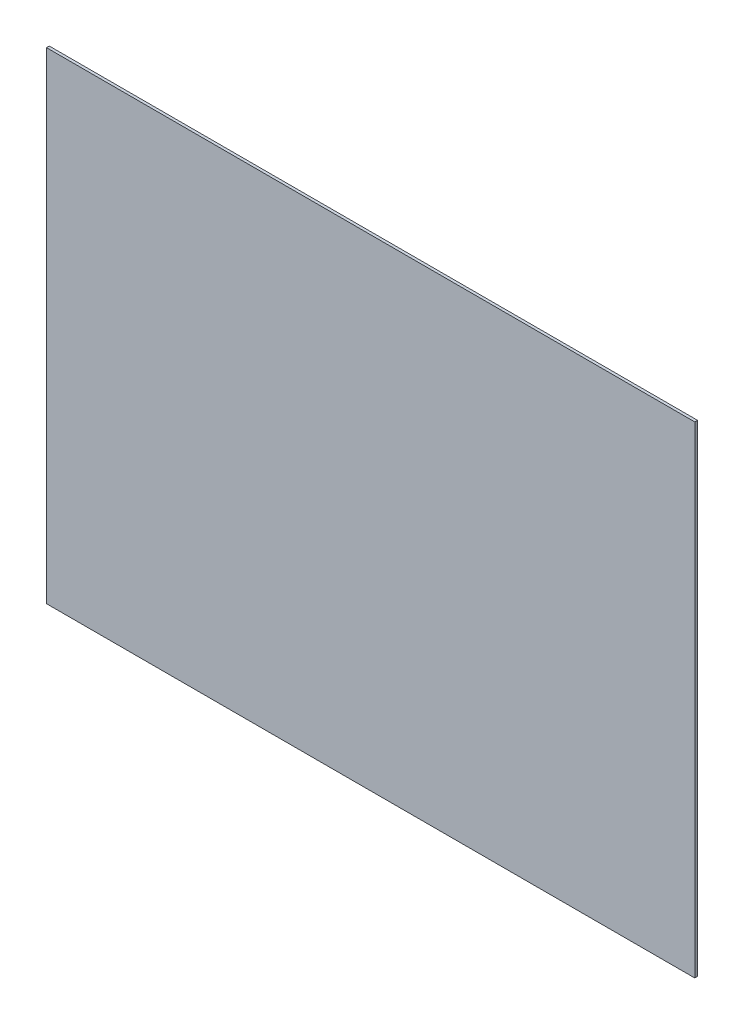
ISO-10303-21;
HEADER;
FILE_DESCRIPTION(('STEP AP214'),'2;1');
FILE_NAME('part.step','',(''),(''),'','','');
FILE_SCHEMA(('AUTOMOTIVE_DESIGN { 1 0 10303 214 1 1 1 1 }'));
ENDSEC;
DATA;
#1=APPLICATION_CONTEXT('core data for automotive mechanical design processes');
#2=APPLICATION_PROTOCOL_DEFINITION('international standard','automotive_design',2000,#1);
#3=PRODUCT_CONTEXT('',#1,'mechanical');
#4=PRODUCT('Part','Part','',(#3));
#5=PRODUCT_RELATED_PRODUCT_CATEGORY('part','',(#4));
#6=PRODUCT_DEFINITION_FORMATION('','',#4);
#7=PRODUCT_DEFINITION_CONTEXT('part definition',#1,'design');
#8=PRODUCT_DEFINITION('design','',#6,#7);
#9=PRODUCT_DEFINITION_SHAPE('','',#8);
#10=(LENGTH_UNIT() NAMED_UNIT(*) SI_UNIT(.MILLI.,.METRE.));
#11=(NAMED_UNIT(*) PLANE_ANGLE_UNIT() SI_UNIT($,.RADIAN.));
#12=(NAMED_UNIT(*) SI_UNIT($,.STERADIAN.) SOLID_ANGLE_UNIT());
#13=UNCERTAINTY_MEASURE_WITH_UNIT(LENGTH_MEASURE(1.E-05),#10,'distance_accuracy_value','');
#14=(GEOMETRIC_REPRESENTATION_CONTEXT(3) GLOBAL_UNCERTAINTY_ASSIGNED_CONTEXT((#13)) GLOBAL_UNIT_ASSIGNED_CONTEXT((#10,
#11,#12)) REPRESENTATION_CONTEXT('',''));
#15=CARTESIAN_POINT('',(0.,0.,0.));
#16=DIRECTION('',(0.,0.,1.));
#17=DIRECTION('',(1.,0.,0.));
#18=AXIS2_PLACEMENT_3D('',#15,#16,#17);
#19=CARTESIAN_POINT('',(-40.,27.,0.300000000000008));
#20=DIRECTION('',(0.,0.,-1.));
#21=DIRECTION('',(-1.,0.,0.));
#22=AXIS2_PLACEMENT_3D('',#19,#20,#21);
#23=PLANE('',#22);
#24=DIRECTION('',(1.,0.,0.));
#25=VECTOR('',#24,1.);
#26=CARTESIAN_POINT('',(30.,-25.,0.299999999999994));
#27=LINE('',#26,#25);
#28=CARTESIAN_POINT('',(30.,-25.,0.299999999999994));
#29=VERTEX_POINT('',#28);
#30=CARTESIAN_POINT('',(-40.,-25.,0.300000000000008));
#31=VERTEX_POINT('',#30);
#32=EDGE_CURVE('E79',#29,#31,#27,.F.);
#33=ORIENTED_EDGE('',*,*,#32,.F.);
#34=DIRECTION('',(0.,1.,0.));
#35=VECTOR('',#34,1.);
#36=CARTESIAN_POINT('',(30.,27.,0.299999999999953));
#37=LINE('',#36,#35);
#38=CARTESIAN_POINT('',(30.,27.,0.299999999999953));
#39=VERTEX_POINT('',#38);
#40=EDGE_CURVE('E67',#39,#29,#37,.F.);
#41=ORIENTED_EDGE('',*,*,#40,.F.);
#42=DIRECTION('',(1.,0.,0.));
#43=VECTOR('',#42,1.);
#44=CARTESIAN_POINT('',(-40.,27.,0.300000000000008));
#45=LINE('',#44,#43);
#46=CARTESIAN_POINT('',(-40.,27.,0.300000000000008));
#47=VERTEX_POINT('',#46);
#48=EDGE_CURVE('E54',#47,#39,#45,.T.);
#49=ORIENTED_EDGE('',*,*,#48,.F.);
#50=DIRECTION('',(0.,1.,0.));
#51=VECTOR('',#50,1.);
#52=CARTESIAN_POINT('',(-40.,-25.,0.300000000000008));
#53=LINE('',#52,#51);
#54=EDGE_CURVE('E19',#31,#47,#53,.T.);
#55=ORIENTED_EDGE('',*,*,#54,.F.);
#56=EDGE_LOOP('',(#33,#41,#49,#55));
#57=FACE_BOUND('',#56,.T.);
#58=ADVANCED_FACE('F16',(#57),#23,.F.);
#59=CARTESIAN_POINT('',(-40.,-25.,0.300000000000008));
#60=DIRECTION('',(-1.,0.,0.));
#61=DIRECTION('',(0.,0.,1.));
#62=AXIS2_PLACEMENT_3D('',#59,#60,#61);
#63=PLANE('',#62);
#64=ORIENTED_EDGE('',*,*,#54,.T.);
#65=DIRECTION('',(0.,0.,1.));
#66=VECTOR('',#65,1.);
#67=CARTESIAN_POINT('',(-40.,27.,0.300000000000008));
#68=LINE('',#67,#66);
#69=CARTESIAN_POINT('',(-40.,27.,0.));
#70=VERTEX_POINT('',#69);
#71=EDGE_CURVE('E60',#70,#47,#68,.T.);
#72=ORIENTED_EDGE('',*,*,#71,.F.);
#73=DIRECTION('',(0.,1.,0.));
#74=VECTOR('',#73,1.);
#75=CARTESIAN_POINT('',(-40.,27.,0.));
#76=LINE('',#75,#74);
#77=CARTESIAN_POINT('',(-40.,-25.,0.));
#78=VERTEX_POINT('',#77);
#79=EDGE_CURVE('E82',#78,#70,#76,.T.);
#80=ORIENTED_EDGE('',*,*,#79,.F.);
#81=DIRECTION('',(0.,0.,-1.));
#82=VECTOR('',#81,1.);
#83=CARTESIAN_POINT('',(-40.,-25.,0.300000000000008));
#84=LINE('',#83,#82);
#85=EDGE_CURVE('E63',#31,#78,#84,.T.);
#86=ORIENTED_EDGE('',*,*,#85,.F.);
#87=EDGE_LOOP('',(#64,#72,#80,#86));
#88=FACE_BOUND('',#87,.T.);
#89=ADVANCED_FACE('F59',(#88),#63,.T.);
#90=CARTESIAN_POINT('',(-40.,27.,0.300000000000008));
#91=DIRECTION('',(0.,1.,0.));
#92=DIRECTION('',(0.,0.,1.));
#93=AXIS2_PLACEMENT_3D('',#90,#91,#92);
#94=PLANE('',#93);
#95=ORIENTED_EDGE('',*,*,#48,.T.);
#96=DIRECTION('',(0.,0.,-1.));
#97=VECTOR('',#96,1.);
#98=CARTESIAN_POINT('',(30.,27.,0.299999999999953));
#99=LINE('',#98,#97);
#100=CARTESIAN_POINT('',(30.,27.,0.));
#101=VERTEX_POINT('',#100);
#102=EDGE_CURVE('E69',#101,#39,#99,.F.);
#103=ORIENTED_EDGE('',*,*,#102,.F.);
#104=DIRECTION('',(-1.,0.,0.));
#105=VECTOR('',#104,1.);
#106=CARTESIAN_POINT('',(-40.,27.,0.));
#107=LINE('',#106,#105);
#108=EDGE_CURVE('E73',#70,#101,#107,.F.);
#109=ORIENTED_EDGE('',*,*,#108,.F.);
#110=ORIENTED_EDGE('',*,*,#71,.T.);
#111=EDGE_LOOP('',(#95,#103,#109,#110));
#112=FACE_BOUND('',#111,.T.);
#113=ADVANCED_FACE('F71',(#112),#94,.T.);
#114=CARTESIAN_POINT('',(30.,27.,0.299999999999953));
#115=DIRECTION('',(1.,0.,0.));
#116=DIRECTION('',(0.,0.,-1.));
#117=AXIS2_PLACEMENT_3D('',#114,#115,#116);
#118=PLANE('',#117);
#119=ORIENTED_EDGE('',*,*,#40,.T.);
#120=DIRECTION('',(0.,0.,-1.));
#121=VECTOR('',#120,1.);
#122=CARTESIAN_POINT('',(30.,-25.,0.299999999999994));
#123=LINE('',#122,#121);
#124=CARTESIAN_POINT('',(30.,-25.,0.));
#125=VERTEX_POINT('',#124);
#126=EDGE_CURVE('E34',#125,#29,#123,.F.);
#127=ORIENTED_EDGE('',*,*,#126,.F.);
#128=DIRECTION('',(0.,1.,0.));
#129=VECTOR('',#128,1.);
#130=CARTESIAN_POINT('',(30.,27.,0.));
#131=LINE('',#130,#129);
#132=EDGE_CURVE('E25',#101,#125,#131,.F.);
#133=ORIENTED_EDGE('',*,*,#132,.F.);
#134=ORIENTED_EDGE('',*,*,#102,.T.);
#135=EDGE_LOOP('',(#119,#127,#133,#134));
#136=FACE_BOUND('',#135,.T.);
#137=ADVANCED_FACE('F88',(#136),#118,.T.);
#138=CARTESIAN_POINT('',(30.,-25.,0.299999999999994));
#139=DIRECTION('',(0.,-1.,0.));
#140=DIRECTION('',(0.,0.,-1.));
#141=AXIS2_PLACEMENT_3D('',#138,#139,#140);
#142=PLANE('',#141);
#143=ORIENTED_EDGE('',*,*,#32,.T.);
#144=ORIENTED_EDGE('',*,*,#85,.T.);
#145=DIRECTION('',(-1.,0.,0.));
#146=VECTOR('',#145,1.);
#147=CARTESIAN_POINT('',(-40.,-25.,0.));
#148=LINE('',#147,#146);
#149=EDGE_CURVE('E11',#125,#78,#148,.T.);
#150=ORIENTED_EDGE('',*,*,#149,.F.);
#151=ORIENTED_EDGE('',*,*,#126,.T.);
#152=EDGE_LOOP('',(#143,#144,#150,#151));
#153=FACE_BOUND('',#152,.T.);
#154=ADVANCED_FACE('F90',(#153),#142,.T.);
#155=CARTESIAN_POINT('',(-40.,27.,0.));
#156=DIRECTION('',(0.,0.,-1.));
#157=DIRECTION('',(-1.,0.,0.));
#158=AXIS2_PLACEMENT_3D('',#155,#156,#157);
#159=PLANE('',#158);
#160=ORIENTED_EDGE('',*,*,#132,.T.);
#161=ORIENTED_EDGE('',*,*,#149,.T.);
#162=ORIENTED_EDGE('',*,*,#79,.T.);
#163=ORIENTED_EDGE('',*,*,#108,.T.);
#164=EDGE_LOOP('',(#160,#161,#162,#163));
#165=FACE_BOUND('',#164,.T.);
#166=ADVANCED_FACE('F87',(#165),#159,.T.);
#167=CLOSED_SHELL('',(#58,#89,#113,#137,#154,#166));
#168=MANIFOLD_SOLID_BREP('B1',#167);
#169=ADVANCED_BREP_SHAPE_REPRESENTATION('',(#18,#168),#14);
#170=SHAPE_DEFINITION_REPRESENTATION(#9,#169);
ENDSEC;
END-ISO-10303-21;
